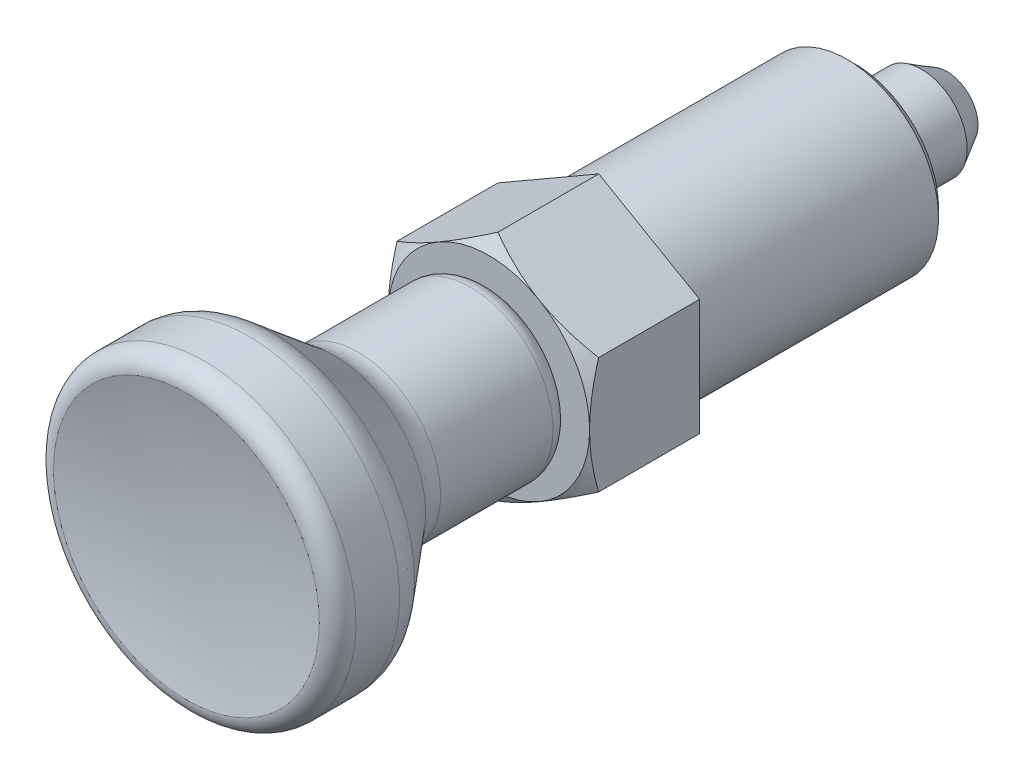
ISO-10303-21;
HEADER;
FILE_DESCRIPTION(('STEP AP214'),'2;1');
FILE_NAME('part.step','',(''),(''),'','','');
FILE_SCHEMA(('AUTOMOTIVE_DESIGN { 1 0 10303 214 1 1 1 1 }'));
ENDSEC;
DATA;
#1=APPLICATION_CONTEXT('core data for automotive mechanical design processes');
#2=APPLICATION_PROTOCOL_DEFINITION('international standard','automotive_design',2000,#1);
#3=PRODUCT_CONTEXT('',#1,'mechanical');
#4=PRODUCT('Part','Part','',(#3));
#5=PRODUCT_RELATED_PRODUCT_CATEGORY('part','',(#4));
#6=PRODUCT_DEFINITION_FORMATION('','',#4);
#7=PRODUCT_DEFINITION_CONTEXT('part definition',#1,'design');
#8=PRODUCT_DEFINITION('design','',#6,#7);
#9=PRODUCT_DEFINITION_SHAPE('','',#8);
#10=(LENGTH_UNIT() NAMED_UNIT(*) SI_UNIT(.MILLI.,.METRE.));
#11=(NAMED_UNIT(*) PLANE_ANGLE_UNIT() SI_UNIT($,.RADIAN.));
#12=(NAMED_UNIT(*) SI_UNIT($,.STERADIAN.) SOLID_ANGLE_UNIT());
#13=UNCERTAINTY_MEASURE_WITH_UNIT(LENGTH_MEASURE(1.E-05),#10,'distance_accuracy_value','');
#14=(GEOMETRIC_REPRESENTATION_CONTEXT(3) GLOBAL_UNCERTAINTY_ASSIGNED_CONTEXT((#13)) GLOBAL_UNIT_ASSIGNED_CONTEXT((#10,
#11,#12)) REPRESENTATION_CONTEXT('',''));
#15=CARTESIAN_POINT('',(0.,0.,0.));
#16=DIRECTION('',(0.,0.,1.));
#17=DIRECTION('',(1.,0.,0.));
#18=AXIS2_PLACEMENT_3D('',#15,#16,#17);
#19=CARTESIAN_POINT('',(0.,0.,9.1132486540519));
#20=DIRECTION('',(0.,0.,-1.));
#21=DIRECTION('',(0.,1.,0.));
#22=AXIS2_PLACEMENT_3D('',#19,#20,#21);
#23=CONICAL_SURFACE('',#22,16.,1.0471975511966);
#24=CARTESIAN_POINT('',(-11.,17.1089612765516,6.60753491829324));
#25=CARTESIAN_POINT('',(-11.,16.8685442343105,6.72428797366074));
#26=CARTESIAN_POINT('',(-11.,16.6278464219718,6.84046259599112));
#27=CARTESIAN_POINT('',(-11.,16.1458306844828,7.07152407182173));
#28=CARTESIAN_POINT('',(-11.,15.9045127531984,7.18641091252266));
#29=CARTESIAN_POINT('',(-11.,15.1794773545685,7.52897336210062));
#30=CARTESIAN_POINT('',(-11.,14.6947486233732,7.7545166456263));
#31=CARTESIAN_POINT('',(-11.,13.7194498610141,8.19976636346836));
#32=CARTESIAN_POINT('',(-11.,13.2288624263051,8.41943476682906));
#33=CARTESIAN_POINT('',(-11.,12.2438036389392,8.84985222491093));
#34=CARTESIAN_POINT('',(-11.,11.7493324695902,9.06060169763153));
#35=CARTESIAN_POINT('',(-11.,10.7395451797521,9.47750065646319));
#36=CARTESIAN_POINT('',(-11.,10.2240743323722,9.68327731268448));
#37=CARTESIAN_POINT('',(-11.,9.18711668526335,10.0793777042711));
#38=CARTESIAN_POINT('',(-11.,8.66562922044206,10.2696997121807));
#39=CARTESIAN_POINT('',(-11.,7.61678576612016,10.6299278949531));
#40=CARTESIAN_POINT('',(-11.,7.08944393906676,10.7998749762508));
#41=CARTESIAN_POINT('',(-11.,6.02714586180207,11.1139425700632));
#42=CARTESIAN_POINT('',(-11.,5.49219205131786,11.2580711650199));
#43=CARTESIAN_POINT('',(-11.,4.68544300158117,11.4493131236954));
#44=CARTESIAN_POINT('',(-11.,4.41655677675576,11.5087715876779));
#45=CARTESIAN_POINT('',(-11.,3.87693780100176,11.6186688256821));
#46=CARTESIAN_POINT('',(-11.,3.60620508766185,11.669107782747));
#47=CARTESIAN_POINT('',(-11.,3.0630760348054,11.7600787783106));
#48=CARTESIAN_POINT('',(-11.,2.79067972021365,11.8006109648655));
#49=CARTESIAN_POINT('',(-11.,2.24450818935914,11.8709617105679));
#50=CARTESIAN_POINT('',(-11.,1.97073302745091,11.9007806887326));
#51=CARTESIAN_POINT('',(-11.,1.42578233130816,11.9487360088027));
#52=CARTESIAN_POINT('',(-11.,1.15461993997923,11.9670207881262));
#53=CARTESIAN_POINT('',(-11.,0.611765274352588,11.9921040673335));
#54=CARTESIAN_POINT('',(-11.,0.340073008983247,11.9989027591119));
#55=CARTESIAN_POINT('',(-11.,-0.203355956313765,12.0008519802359));
#56=CARTESIAN_POINT('',(-11.,-0.475092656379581,11.996002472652));
#57=CARTESIAN_POINT('',(-11.,-1.01811847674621,11.9747741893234));
#58=CARTESIAN_POINT('',(-11.,-1.28940757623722,11.9583948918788));
#59=CARTESIAN_POINT('',(-11.,-1.93990342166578,11.9056460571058));
#60=CARTESIAN_POINT('',(-11.,-2.31868109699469,11.8638892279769));
#61=CARTESIAN_POINT('',(-11.,-3.07346021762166,11.7601616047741));
#62=CARTESIAN_POINT('',(-11.,-3.44946128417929,11.6981881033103));
#63=CARTESIAN_POINT('',(-11.,-4.19831711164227,11.5562316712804));
#64=CARTESIAN_POINT('',(-11.,-4.57116920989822,11.4762348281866));
#65=CARTESIAN_POINT('',(-11.,-5.31315026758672,11.3006758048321));
#66=CARTESIAN_POINT('',(-11.,-5.6822792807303,11.2051138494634));
#67=CARTESIAN_POINT('',(-11.,-6.42494682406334,10.9984902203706));
#68=CARTESIAN_POINT('',(-11.,-6.798402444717,10.8871326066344));
#69=CARTESIAN_POINT('',(-11.,-7.54163547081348,10.6528156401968));
#70=CARTESIAN_POINT('',(-11.,-7.91141285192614,10.5298562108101));
#71=CARTESIAN_POINT('',(-11.,-8.64747031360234,10.2742963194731));
#72=CARTESIAN_POINT('',(-11.,-9.01375149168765,10.1416990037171));
#73=CARTESIAN_POINT('',(-11.,-9.74327252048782,9.86843269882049));
#74=CARTESIAN_POINT('',(-11.,-10.1065124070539,9.72776380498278));
#75=CARTESIAN_POINT('',(-11.,-10.9643323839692,9.38634256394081));
#76=CARTESIAN_POINT('',(-11.,-11.4577333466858,9.18263211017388));
#77=CARTESIAN_POINT('',(-11.,-12.4403196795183,8.76525696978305));
#78=CARTESIAN_POINT('',(-11.,-12.929504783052,8.5515916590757));
#79=CARTESIAN_POINT('',(-11.,-13.9044452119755,8.11630224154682));
#80=CARTESIAN_POINT('',(-11.,-14.3901997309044,7.8946763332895));
#81=CARTESIAN_POINT('',(-11.,-15.3587405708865,7.44507392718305));
#82=CARTESIAN_POINT('',(-11.,-15.8415269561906,7.21709756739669));
#83=CARTESIAN_POINT('',(-11.,-16.8051585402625,6.75572750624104));
#84=CARTESIAN_POINT('',(-11.,-17.28600099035,6.52232807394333));
#85=CARTESIAN_POINT('',(-11.,-18.2456015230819,6.05128373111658));
#86=CARTESIAN_POINT('',(-11.,-18.7243595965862,5.81363880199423));
#87=CARTESIAN_POINT('',(-11.,-19.680049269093,5.33486366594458));
#88=CARTESIAN_POINT('',(-11.,-20.1569810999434,5.09373392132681));
#89=CARTESIAN_POINT('',(-11.,-21.1093452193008,4.60852948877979));
#90=CARTESIAN_POINT('',(-11.,-21.5847775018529,4.36445478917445));
#91=CARTESIAN_POINT('',(-11.,-22.9292051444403,3.66982978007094));
#92=CARTESIAN_POINT('',(-11.,-23.7966959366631,3.21636748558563));
#93=CARTESIAN_POINT('',(-11.,-25.5284407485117,2.30324363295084));
#94=CARTESIAN_POINT('',(-11.,-26.3926946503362,1.8435818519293));
#95=CARTESIAN_POINT('',(-11.,-28.1164832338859,0.920679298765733));
#96=CARTESIAN_POINT('',(-11.,-28.9760243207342,0.457450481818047));
#97=CARTESIAN_POINT('',(-11.,-30.2638094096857,-0.240150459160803));
#98=CARTESIAN_POINT('',(-11.,-30.6928049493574,-0.473137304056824));
#99=CARTESIAN_POINT('',(-11.,-31.5503448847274,-0.939938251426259));
#100=CARTESIAN_POINT('',(-11.,-31.9788892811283,-1.17375235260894));
#101=CARTESIAN_POINT('',(-11.,-32.4072336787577,-1.40793238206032));
#102=B_SPLINE_CURVE_WITH_KNOTS('',3,(#24,#25,#26,#27,#28,#29,#30,#31,#32,#33,#34,#35,#36,#37,
#38,#39,#40,#41,#42,#43,#44,#45,#46,#47,#48,#49,#50,#51,#52,#53,#54,#55,#56,#57,#58,#59,#60,#61,
#62,#63,#64,#65,#66,#67,#68,#69,#70,#71,#72,#73,#74,#75,#76,#77,#78,#79,#80,#81,#82,#83,#84,#85,
#86,#87,#88,#89,#90,#91,#92,#93,#94,#95,#96,#97,#98,#99,#100,#101),.UNSPECIFIED.,.F.,.F.,(4,2,2,
2,2,2,2,2,2,2,2,2,2,2,2,2,2,2,2,2,2,2,2,2,2,2,2,2,2,2,2,2,2,2,2,2,2,2,4),(0.,0.801799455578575,
1.60360687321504,3.20745640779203,4.81995415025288,6.43237623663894,8.09726600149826,
9.7623416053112,11.424016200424,13.0851696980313,13.9111881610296,14.7371898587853,
15.5631792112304,16.3891362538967,17.2042344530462,18.0193190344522,18.834406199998,
19.649530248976,20.7921162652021,21.9348553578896,23.0784795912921,24.2220873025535,
25.3909758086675,26.5598720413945,27.7283883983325,28.8968909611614,30.498142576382,
32.0994947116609,33.7012115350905,35.3028935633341,36.9063529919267,38.5098194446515,
40.1130750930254,41.7163371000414,44.6528813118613,47.5895313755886,50.5187725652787,
51.9833129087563,53.4478509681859),.UNSPECIFIED.);
#103=CARTESIAN_POINT('',(-11.,-6.3508529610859,11.0175196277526));
#104=VERTEX_POINT('',#103);
#105=CARTESIAN_POINT('',(-11.,0.,12.));
#106=VERTEX_POINT('',#105);
#107=EDGE_CURVE('E9',#104,#106,#102,.F.);
#108=ORIENTED_EDGE('',*,*,#107,.F.);
#109=CARTESIAN_POINT('',(0.000200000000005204,-12.7018213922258,11.0174529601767));
#110=CARTESIAN_POINT('',(-0.241603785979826,-12.5622159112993,11.0980408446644));
#111=CARTESIAN_POINT('',(-0.484309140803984,-12.4220899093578,11.1749710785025));
#112=CARTESIAN_POINT('',(-0.971666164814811,-12.1407142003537,11.3205013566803));
#113=CARTESIAN_POINT('',(-1.21631844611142,-11.9994641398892,11.3890986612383));
#114=CARTESIAN_POINT('',(-1.95421736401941,-11.5734380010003,11.5810636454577));
#115=CARTESIAN_POINT('',(-2.45037695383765,-11.2869801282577,11.6902522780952));
#116=CARTESIAN_POINT('',(-3.19285703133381,-10.8583090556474,11.8182858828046));
#117=CARTESIAN_POINT('',(-3.43695934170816,-10.7173765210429,11.8547577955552));
#118=CARTESIAN_POINT('',(-3.92629418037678,-10.4348589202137,11.9159186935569));
#119=CARTESIAN_POINT('',(-4.17152673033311,-10.2932738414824,11.9406074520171));
#120=CARTESIAN_POINT('',(-4.6624006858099,-10.0098676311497,11.9775696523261));
#121=CARTESIAN_POINT('',(-4.90804125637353,-9.86804698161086,11.9898578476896));
#122=CARTESIAN_POINT('',(-5.39955001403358,-9.58427426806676,12.0017570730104));
#123=CARTESIAN_POINT('',(-5.64541819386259,-9.44232220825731,12.0013684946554));
#124=CARTESIAN_POINT('',(-6.1050701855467,-9.17694200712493,11.9887988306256));
#125=CARTESIAN_POINT('',(-6.31888677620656,-9.05349494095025,11.9781509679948));
#126=CARTESIAN_POINT('',(-6.74602818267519,-8.80688473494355,11.9474683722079));
#127=CARTESIAN_POINT('',(-6.95935296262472,-8.68372161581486,11.9274329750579));
#128=CARTESIAN_POINT('',(-7.38539481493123,-8.43774623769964,11.8783246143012));
#129=CARTESIAN_POINT('',(-7.59811123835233,-8.31493435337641,11.8492441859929));
#130=CARTESIAN_POINT('',(-8.0225468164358,-8.06988635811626,11.7825560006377));
#131=CARTESIAN_POINT('',(-8.23426590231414,-7.94765028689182,11.7449476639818));
#132=CARTESIAN_POINT('',(-8.87695113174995,-7.57659579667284,11.6183800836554));
#133=CARTESIAN_POINT('',(-9.30605612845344,-7.32885191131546,11.5168005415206));
#134=CARTESIAN_POINT('',(-10.1578675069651,-6.83705838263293,11.2862563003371));
#135=CARTESIAN_POINT('',(-10.580584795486,-6.59300244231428,11.1573457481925));
#136=CARTESIAN_POINT('',(-11.0002,-6.35073749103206,11.0174529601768));
#137=B_SPLINE_CURVE_WITH_KNOTS('',3,(#109,#110,#111,#112,#113,#114,#115,#116,#117,#118,#119,
#120,#121,#122,#123,#124,#125,#126,#127,#128,#129,#130,#131,#132,#133,#134,#135,#136),
.UNSPECIFIED.,.F.,.F.,(4,2,2,2,2,2,2,2,2,2,2,2,2,4),(0.,0.871755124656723,1.74379610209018,
3.49159027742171,4.34403665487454,5.19649943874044,6.0479468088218,6.89936787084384,
7.64056020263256,8.38180496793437,9.12366309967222,9.86557166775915,11.3820155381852,
12.8954827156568),.UNSPECIFIED.);
#138=CARTESIAN_POINT('',(-5.50000000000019,-9.52627944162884,12.));
#139=VERTEX_POINT('',#138);
#140=EDGE_CURVE('E204',#139,#104,#137,.T.);
#141=ORIENTED_EDGE('',*,*,#140,.F.);
#142=CARTESIAN_POINT('',(0.,0.,12.));
#143=DIRECTION('',(0.,0.,1.));
#144=DIRECTION('',(0.,-1.,0.));
#145=AXIS2_PLACEMENT_3D('',#142,#143,#144);
#146=CIRCLE('',#145,11.);
#147=EDGE_CURVE('E262',#106,#139,#146,.T.);
#148=ORIENTED_EDGE('',*,*,#147,.F.);
#149=EDGE_LOOP('',(#108,#141,#148));
#150=FACE_BOUND('',#149,.T.);
#151=ADVANCED_FACE('F14',(#150),#23,.T.);
#152=CARTESIAN_POINT('',(-11.,6.3508529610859,11.0175196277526));
#153=VERTEX_POINT('',#152);
#154=EDGE_CURVE('E18',#106,#153,#102,.F.);
#155=ORIENTED_EDGE('',*,*,#154,.F.);
#156=CARTESIAN_POINT('',(-5.50000000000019,9.52627944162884,12.));
#157=VERTEX_POINT('',#156);
#158=EDGE_CURVE('E116',#157,#106,#146,.T.);
#159=ORIENTED_EDGE('',*,*,#158,.F.);
#160=CARTESIAN_POINT('',(-11.0002,6.35073749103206,11.0174529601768));
#161=CARTESIAN_POINT('',(-10.7583962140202,6.49034297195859,11.0980408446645));
#162=CARTESIAN_POINT('',(-10.515690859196,6.63046897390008,11.1749710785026));
#163=CARTESIAN_POINT('',(-10.0283338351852,6.91184468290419,11.3205013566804));
#164=CARTESIAN_POINT('',(-9.78368155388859,7.05309474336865,11.3890986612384));
#165=CARTESIAN_POINT('',(-9.04578263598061,7.47912088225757,11.5810636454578));
#166=CARTESIAN_POINT('',(-8.54962304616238,7.76557875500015,11.6902522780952));
#167=CARTESIAN_POINT('',(-7.80714296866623,8.1942498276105,11.8182858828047));
#168=CARTESIAN_POINT('',(-7.56304065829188,8.33518236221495,11.8547577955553));
#169=CARTESIAN_POINT('',(-7.07370581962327,8.61769996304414,11.915918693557));
#170=CARTESIAN_POINT('',(-6.82847326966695,8.75928504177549,11.9406074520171));
#171=CARTESIAN_POINT('',(-6.33759931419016,9.0426912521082,11.9775696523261));
#172=CARTESIAN_POINT('',(-6.09195874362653,9.184511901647,11.9898578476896));
#173=CARTESIAN_POINT('',(-5.60044998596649,9.4682846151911,12.0017570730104));
#174=CARTESIAN_POINT('',(-5.35458180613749,9.61023667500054,12.0013684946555));
#175=CARTESIAN_POINT('',(-4.89492981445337,9.87561687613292,11.9887988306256));
#176=CARTESIAN_POINT('',(-4.68111322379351,9.99906394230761,11.9781509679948));
#177=CARTESIAN_POINT('',(-4.25397181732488,10.2456741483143,11.9474683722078));
#178=CARTESIAN_POINT('',(-4.04064703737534,10.368837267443,11.9274329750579));
#179=CARTESIAN_POINT('',(-3.61460518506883,10.6148126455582,11.8783246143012));
#180=CARTESIAN_POINT('',(-3.40188876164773,10.7376245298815,11.8492441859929));
#181=CARTESIAN_POINT('',(-2.97745318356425,10.9826725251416,11.7825560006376));
#182=CARTESIAN_POINT('',(-2.76573409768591,11.1049085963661,11.7449476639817));
#183=CARTESIAN_POINT('',(-2.12304886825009,11.475963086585,11.6183800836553));
#184=CARTESIAN_POINT('',(-1.69394387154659,11.7237069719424,11.5168005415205));
#185=CARTESIAN_POINT('',(-0.842132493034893,12.215500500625,11.286256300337));
#186=CARTESIAN_POINT('',(-0.419415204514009,12.4595564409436,11.1573457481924));
#187=CARTESIAN_POINT('',(0.000199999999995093,12.7018213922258,11.0174529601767));
#188=B_SPLINE_CURVE_WITH_KNOTS('',3,(#160,#161,#162,#163,#164,#165,#166,#167,#168,#169,#170,
#171,#172,#173,#174,#175,#176,#177,#178,#179,#180,#181,#182,#183,#184,#185,#186,#187),
.UNSPECIFIED.,.F.,.F.,(4,2,2,2,2,2,2,2,2,2,2,2,2,4),(0.,0.871755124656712,1.74379610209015,
3.49159027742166,4.34403665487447,5.19649943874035,6.0479468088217,6.89936787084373,
7.64056020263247,8.38180496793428,9.12366309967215,9.86557166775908,11.3820155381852,
12.8954827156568),.UNSPECIFIED.);
#189=EDGE_CURVE('E265',#153,#157,#188,.T.);
#190=ORIENTED_EDGE('',*,*,#189,.F.);
#191=EDGE_LOOP('',(#155,#159,#190));
#192=FACE_BOUND('',#191,.T.);
#193=ADVANCED_FACE('F226',(#192),#23,.T.);
#194=CARTESIAN_POINT('',(0.,12.701705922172,11.0175196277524));
#195=VERTEX_POINT('',#194);
#196=EDGE_CURVE('E112',#157,#195,#188,.T.);
#197=ORIENTED_EDGE('',*,*,#196,.F.);
#198=CARTESIAN_POINT('',(5.50000000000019,9.52627944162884,12.));
#199=VERTEX_POINT('',#198);
#200=EDGE_CURVE('E110',#199,#157,#146,.T.);
#201=ORIENTED_EDGE('',*,*,#200,.F.);
#202=CARTESIAN_POINT('',(-0.000200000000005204,12.7018213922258,11.0174529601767));
#203=CARTESIAN_POINT('',(0.241603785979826,12.5622159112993,11.0980408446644));
#204=CARTESIAN_POINT('',(0.484309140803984,12.4220899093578,11.1749710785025));
#205=CARTESIAN_POINT('',(0.971666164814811,12.1407142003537,11.3205013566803));
#206=CARTESIAN_POINT('',(1.21631844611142,11.9994641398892,11.3890986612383));
#207=CARTESIAN_POINT('',(1.95421736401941,11.5734380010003,11.5810636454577));
#208=CARTESIAN_POINT('',(2.45037695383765,11.2869801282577,11.6902522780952));
#209=CARTESIAN_POINT('',(3.19285703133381,10.8583090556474,11.8182858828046));
#210=CARTESIAN_POINT('',(3.43695934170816,10.7173765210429,11.8547577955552));
#211=CARTESIAN_POINT('',(3.92629418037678,10.4348589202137,11.9159186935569));
#212=CARTESIAN_POINT('',(4.17152673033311,10.2932738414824,11.9406074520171));
#213=CARTESIAN_POINT('',(4.6624006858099,10.0098676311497,11.9775696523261));
#214=CARTESIAN_POINT('',(4.90804125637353,9.86804698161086,11.9898578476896));
#215=CARTESIAN_POINT('',(5.39955001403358,9.58427426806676,12.0017570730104));
#216=CARTESIAN_POINT('',(5.64541819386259,9.44232220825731,12.0013684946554));
#217=CARTESIAN_POINT('',(6.1050701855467,9.17694200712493,11.9887988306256));
#218=CARTESIAN_POINT('',(6.31888677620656,9.05349494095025,11.9781509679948));
#219=CARTESIAN_POINT('',(6.74602818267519,8.80688473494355,11.9474683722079));
#220=CARTESIAN_POINT('',(6.95935296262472,8.68372161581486,11.9274329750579));
#221=CARTESIAN_POINT('',(7.38539481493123,8.43774623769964,11.8783246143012));
#222=CARTESIAN_POINT('',(7.59811123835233,8.31493435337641,11.8492441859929));
#223=CARTESIAN_POINT('',(8.0225468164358,8.06988635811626,11.7825560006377));
#224=CARTESIAN_POINT('',(8.23426590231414,7.94765028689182,11.7449476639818));
#225=CARTESIAN_POINT('',(8.87695113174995,7.57659579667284,11.6183800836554));
#226=CARTESIAN_POINT('',(9.30605612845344,7.32885191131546,11.5168005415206));
#227=CARTESIAN_POINT('',(10.1578675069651,6.83705838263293,11.2862563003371));
#228=CARTESIAN_POINT('',(10.580584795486,6.59300244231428,11.1573457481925));
#229=CARTESIAN_POINT('',(11.0002,6.35073749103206,11.0174529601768));
#230=B_SPLINE_CURVE_WITH_KNOTS('',3,(#202,#203,#204,#205,#206,#207,#208,#209,#210,#211,#212,
#213,#214,#215,#216,#217,#218,#219,#220,#221,#222,#223,#224,#225,#226,#227,#228,#229),
.UNSPECIFIED.,.F.,.F.,(4,2,2,2,2,2,2,2,2,2,2,2,2,4),(0.,0.871755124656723,1.74379610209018,
3.49159027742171,4.34403665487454,5.19649943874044,6.0479468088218,6.89936787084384,
7.64056020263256,8.38180496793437,9.12366309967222,9.86557166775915,11.3820155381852,
12.8954827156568),.UNSPECIFIED.);
#231=EDGE_CURVE('E90',#195,#199,#230,.T.);
#232=ORIENTED_EDGE('',*,*,#231,.F.);
#233=EDGE_LOOP('',(#197,#201,#232));
#234=FACE_BOUND('',#233,.T.);
#235=ADVANCED_FACE('F111',(#234),#23,.T.);
#236=CARTESIAN_POINT('',(0.,-12.701705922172,11.0175196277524));
#237=VERTEX_POINT('',#236);
#238=EDGE_CURVE('E199',#237,#139,#137,.T.);
#239=ORIENTED_EDGE('',*,*,#238,.F.);
#240=CARTESIAN_POINT('',(11.0002,-6.35073749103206,11.0174529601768));
#241=CARTESIAN_POINT('',(10.7583962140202,-6.49034297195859,11.0980408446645));
#242=CARTESIAN_POINT('',(10.515690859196,-6.63046897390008,11.1749710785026));
#243=CARTESIAN_POINT('',(10.0283338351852,-6.91184468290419,11.3205013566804));
#244=CARTESIAN_POINT('',(9.78368155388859,-7.05309474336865,11.3890986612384));
#245=CARTESIAN_POINT('',(9.04578263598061,-7.47912088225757,11.5810636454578));
#246=CARTESIAN_POINT('',(8.54962304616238,-7.76557875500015,11.6902522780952));
#247=CARTESIAN_POINT('',(7.80714296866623,-8.1942498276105,11.8182858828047));
#248=CARTESIAN_POINT('',(7.56304065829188,-8.33518236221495,11.8547577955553));
#249=CARTESIAN_POINT('',(7.07370581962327,-8.61769996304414,11.915918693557));
#250=CARTESIAN_POINT('',(6.82847326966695,-8.75928504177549,11.9406074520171));
#251=CARTESIAN_POINT('',(6.33759931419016,-9.0426912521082,11.9775696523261));
#252=CARTESIAN_POINT('',(6.09195874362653,-9.184511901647,11.9898578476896));
#253=CARTESIAN_POINT('',(5.60044998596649,-9.4682846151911,12.0017570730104));
#254=CARTESIAN_POINT('',(5.35458180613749,-9.61023667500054,12.0013684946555));
#255=CARTESIAN_POINT('',(4.89492981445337,-9.87561687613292,11.9887988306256));
#256=CARTESIAN_POINT('',(4.68111322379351,-9.99906394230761,11.9781509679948));
#257=CARTESIAN_POINT('',(4.25397181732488,-10.2456741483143,11.9474683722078));
#258=CARTESIAN_POINT('',(4.04064703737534,-10.368837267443,11.9274329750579));
#259=CARTESIAN_POINT('',(3.61460518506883,-10.6148126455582,11.8783246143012));
#260=CARTESIAN_POINT('',(3.40188876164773,-10.7376245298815,11.8492441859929));
#261=CARTESIAN_POINT('',(2.97745318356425,-10.9826725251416,11.7825560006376));
#262=CARTESIAN_POINT('',(2.76573409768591,-11.1049085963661,11.7449476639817));
#263=CARTESIAN_POINT('',(2.12304886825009,-11.475963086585,11.6183800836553));
#264=CARTESIAN_POINT('',(1.69394387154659,-11.7237069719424,11.5168005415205));
#265=CARTESIAN_POINT('',(0.842132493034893,-12.215500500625,11.286256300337));
#266=CARTESIAN_POINT('',(0.419415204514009,-12.4595564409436,11.1573457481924));
#267=CARTESIAN_POINT('',(-0.000199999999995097,-12.7018213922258,11.0174529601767));
#268=B_SPLINE_CURVE_WITH_KNOTS('',3,(#240,#241,#242,#243,#244,#245,#246,#247,#248,#249,#250,
#251,#252,#253,#254,#255,#256,#257,#258,#259,#260,#261,#262,#263,#264,#265,#266,#267),
.UNSPECIFIED.,.F.,.F.,(4,2,2,2,2,2,2,2,2,2,2,2,2,4),(0.,0.871755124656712,1.74379610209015,
3.49159027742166,4.34403665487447,5.19649943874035,6.0479468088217,6.89936787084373,
7.64056020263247,8.38180496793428,9.12366309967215,9.86557166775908,11.3820155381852,
12.8954827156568),.UNSPECIFIED.);
#269=CARTESIAN_POINT('',(5.50000000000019,-9.52627944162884,12.));
#270=VERTEX_POINT('',#269);
#271=EDGE_CURVE('E100',#270,#237,#268,.T.);
#272=ORIENTED_EDGE('',*,*,#271,.F.);
#273=EDGE_CURVE('E123',#139,#270,#146,.T.);
#274=ORIENTED_EDGE('',*,*,#273,.F.);
#275=EDGE_LOOP('',(#239,#272,#274));
#276=FACE_BOUND('',#275,.T.);
#277=ADVANCED_FACE('F244',(#276),#23,.T.);
#278=CARTESIAN_POINT('',(11.,6.3508529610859,11.0175196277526));
#279=VERTEX_POINT('',#278);
#280=EDGE_CURVE('E94',#199,#279,#230,.T.);
#281=ORIENTED_EDGE('',*,*,#280,.F.);
#282=CARTESIAN_POINT('',(11.,0.,12.));
#283=VERTEX_POINT('',#282);
#284=EDGE_CURVE('E106',#283,#199,#146,.T.);
#285=ORIENTED_EDGE('',*,*,#284,.F.);
#286=CARTESIAN_POINT('',(11.,17.1089612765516,6.60753491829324));
#287=CARTESIAN_POINT('',(11.,16.8685442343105,6.72428797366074));
#288=CARTESIAN_POINT('',(11.,16.6278464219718,6.84046259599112));
#289=CARTESIAN_POINT('',(11.,16.1458306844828,7.07152407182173));
#290=CARTESIAN_POINT('',(11.,15.9045127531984,7.18641091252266));
#291=CARTESIAN_POINT('',(11.,15.1794773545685,7.52897336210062));
#292=CARTESIAN_POINT('',(11.,14.6947486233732,7.7545166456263));
#293=CARTESIAN_POINT('',(11.,13.7194498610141,8.19976636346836));
#294=CARTESIAN_POINT('',(11.,13.2288624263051,8.41943476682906));
#295=CARTESIAN_POINT('',(11.,12.2438036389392,8.84985222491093));
#296=CARTESIAN_POINT('',(11.,11.7493324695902,9.06060169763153));
#297=CARTESIAN_POINT('',(11.,10.7395451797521,9.47750065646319));
#298=CARTESIAN_POINT('',(11.,10.2240743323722,9.68327731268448));
#299=CARTESIAN_POINT('',(11.,9.18711668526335,10.0793777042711));
#300=CARTESIAN_POINT('',(11.,8.66562922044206,10.2696997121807));
#301=CARTESIAN_POINT('',(11.,7.61678576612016,10.6299278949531));
#302=CARTESIAN_POINT('',(11.,7.08944393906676,10.7998749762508));
#303=CARTESIAN_POINT('',(11.,6.02714586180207,11.1139425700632));
#304=CARTESIAN_POINT('',(11.,5.49219205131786,11.2580711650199));
#305=CARTESIAN_POINT('',(11.,4.68544300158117,11.4493131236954));
#306=CARTESIAN_POINT('',(11.,4.41655677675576,11.5087715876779));
#307=CARTESIAN_POINT('',(11.,3.87693780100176,11.6186688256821));
#308=CARTESIAN_POINT('',(11.,3.60620508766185,11.669107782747));
#309=CARTESIAN_POINT('',(11.,3.0630760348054,11.7600787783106));
#310=CARTESIAN_POINT('',(11.,2.79067972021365,11.8006109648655));
#311=CARTESIAN_POINT('',(11.,2.24450818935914,11.8709617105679));
#312=CARTESIAN_POINT('',(11.,1.97073302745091,11.9007806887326));
#313=CARTESIAN_POINT('',(11.,1.42578233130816,11.9487360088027));
#314=CARTESIAN_POINT('',(11.,1.15461993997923,11.9670207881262));
#315=CARTESIAN_POINT('',(11.,0.611765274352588,11.9921040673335));
#316=CARTESIAN_POINT('',(11.,0.340073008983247,11.9989027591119));
#317=CARTESIAN_POINT('',(11.,-0.203355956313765,12.0008519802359));
#318=CARTESIAN_POINT('',(11.,-0.475092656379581,11.996002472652));
#319=CARTESIAN_POINT('',(11.,-1.01811847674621,11.9747741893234));
#320=CARTESIAN_POINT('',(11.,-1.28940757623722,11.9583948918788));
#321=CARTESIAN_POINT('',(11.,-1.93990342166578,11.9056460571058));
#322=CARTESIAN_POINT('',(11.,-2.31868109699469,11.8638892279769));
#323=CARTESIAN_POINT('',(11.,-3.07346021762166,11.7601616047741));
#324=CARTESIAN_POINT('',(11.,-3.44946128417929,11.6981881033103));
#325=CARTESIAN_POINT('',(11.,-4.19831711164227,11.5562316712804));
#326=CARTESIAN_POINT('',(11.,-4.57116920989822,11.4762348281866));
#327=CARTESIAN_POINT('',(11.,-5.31315026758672,11.3006758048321));
#328=CARTESIAN_POINT('',(11.,-5.6822792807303,11.2051138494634));
#329=CARTESIAN_POINT('',(11.,-6.42494682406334,10.9984902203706));
#330=CARTESIAN_POINT('',(11.,-6.798402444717,10.8871326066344));
#331=CARTESIAN_POINT('',(11.,-7.54163547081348,10.6528156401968));
#332=CARTESIAN_POINT('',(11.,-7.91141285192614,10.5298562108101));
#333=CARTESIAN_POINT('',(11.,-8.64747031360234,10.2742963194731));
#334=CARTESIAN_POINT('',(11.,-9.01375149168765,10.1416990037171));
#335=CARTESIAN_POINT('',(11.,-9.74327252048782,9.86843269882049));
#336=CARTESIAN_POINT('',(11.,-10.1065124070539,9.72776380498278));
#337=CARTESIAN_POINT('',(11.,-10.9643323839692,9.38634256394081));
#338=CARTESIAN_POINT('',(11.,-11.4577333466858,9.18263211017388));
#339=CARTESIAN_POINT('',(11.,-12.4403196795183,8.76525696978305));
#340=CARTESIAN_POINT('',(11.,-12.929504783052,8.5515916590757));
#341=CARTESIAN_POINT('',(11.,-13.9044452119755,8.11630224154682));
#342=CARTESIAN_POINT('',(11.,-14.3901997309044,7.8946763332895));
#343=CARTESIAN_POINT('',(11.,-15.3587405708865,7.44507392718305));
#344=CARTESIAN_POINT('',(11.,-15.8415269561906,7.21709756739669));
#345=CARTESIAN_POINT('',(11.,-16.8051585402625,6.75572750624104));
#346=CARTESIAN_POINT('',(11.,-17.28600099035,6.52232807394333));
#347=CARTESIAN_POINT('',(11.,-18.2456015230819,6.05128373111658));
#348=CARTESIAN_POINT('',(11.,-18.7243595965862,5.81363880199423));
#349=CARTESIAN_POINT('',(11.,-19.680049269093,5.33486366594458));
#350=CARTESIAN_POINT('',(11.,-20.1569810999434,5.09373392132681));
#351=CARTESIAN_POINT('',(11.,-21.1093452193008,4.60852948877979));
#352=CARTESIAN_POINT('',(11.,-21.5847775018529,4.36445478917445));
#353=CARTESIAN_POINT('',(11.,-22.9292051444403,3.66982978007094));
#354=CARTESIAN_POINT('',(11.,-23.7966959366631,3.21636748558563));
#355=CARTESIAN_POINT('',(11.,-25.5284407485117,2.30324363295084));
#356=CARTESIAN_POINT('',(11.,-26.3926946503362,1.8435818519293));
#357=CARTESIAN_POINT('',(11.,-28.1164832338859,0.920679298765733));
#358=CARTESIAN_POINT('',(11.,-28.9760243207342,0.457450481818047));
#359=CARTESIAN_POINT('',(11.,-30.2638094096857,-0.240150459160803));
#360=CARTESIAN_POINT('',(11.,-30.6928049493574,-0.473137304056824));
#361=CARTESIAN_POINT('',(11.,-31.5503448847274,-0.939938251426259));
#362=CARTESIAN_POINT('',(11.,-31.9788892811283,-1.17375235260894));
#363=CARTESIAN_POINT('',(11.,-32.4072336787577,-1.40793238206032));
#364=B_SPLINE_CURVE_WITH_KNOTS('',3,(#286,#287,#288,#289,#290,#291,#292,#293,#294,#295,#296,
#297,#298,#299,#300,#301,#302,#303,#304,#305,#306,#307,#308,#309,#310,#311,#312,#313,#314,#315,
#316,#317,#318,#319,#320,#321,#322,#323,#324,#325,#326,#327,#328,#329,#330,#331,#332,#333,#334,
#335,#336,#337,#338,#339,#340,#341,#342,#343,#344,#345,#346,#347,#348,#349,#350,#351,#352,#353,
#354,#355,#356,#357,#358,#359,#360,#361,#362,#363),.UNSPECIFIED.,.F.,.F.,(4,2,2,2,2,2,2,2,2,2,2,
2,2,2,2,2,2,2,2,2,2,2,2,2,2,2,2,2,2,2,2,2,2,2,2,2,2,2,4),(0.,0.801799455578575,1.60360687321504,
3.20745640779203,4.81995415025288,6.43237623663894,8.09726600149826,9.7623416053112,
11.424016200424,13.0851696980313,13.9111881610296,14.7371898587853,15.5631792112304,
16.3891362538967,17.2042344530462,18.0193190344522,18.834406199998,19.649530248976,
20.7921162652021,21.9348553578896,23.0784795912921,24.2220873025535,25.3909758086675,
26.5598720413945,27.7283883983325,28.8968909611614,30.498142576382,32.0994947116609,
33.7012115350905,35.3028935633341,36.9063529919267,38.5098194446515,40.1130750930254,
41.7163371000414,44.6528813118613,47.5895313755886,50.5187725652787,51.9833129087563,
53.4478509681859),.UNSPECIFIED.);
#365=EDGE_CURVE('E41',#279,#283,#364,.T.);
#366=ORIENTED_EDGE('',*,*,#365,.F.);
#367=EDGE_LOOP('',(#281,#285,#366));
#368=FACE_BOUND('',#367,.T.);
#369=ADVANCED_FACE('F104',(#368),#23,.T.);
#370=CARTESIAN_POINT('',(11.,-6.3508529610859,11.0175196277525));
#371=VERTEX_POINT('',#370);
#372=EDGE_CURVE('E108',#371,#270,#268,.T.);
#373=ORIENTED_EDGE('',*,*,#372,.F.);
#374=EDGE_CURVE('E169',#283,#371,#364,.T.);
#375=ORIENTED_EDGE('',*,*,#374,.F.);
#376=EDGE_CURVE('E121',#270,#283,#146,.T.);
#377=ORIENTED_EDGE('',*,*,#376,.F.);
#378=EDGE_LOOP('',(#373,#375,#377));
#379=FACE_BOUND('',#378,.T.);
#380=ADVANCED_FACE('F228',(#379),#23,.T.);
#381=CARTESIAN_POINT('',(-1.11213122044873E-11,0.,109.387498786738));
#382=DIRECTION('',(0.,0.,1.));
#383=DIRECTION('',(1.,0.,0.));
#384=AXIS2_PLACEMENT_3D('',#381,#382,#383);
#385=SPHERICAL_SURFACE('',#384,66.0000000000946);
#386=CARTESIAN_POINT('',(0.,0.,45.));
#387=DIRECTION('',(0.,0.,1.));
#388=DIRECTION('',(0.,-1.,0.));
#389=AXIS2_PLACEMENT_3D('',#386,#387,#388);
#390=CIRCLE('',#389,14.500000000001);
#391=CARTESIAN_POINT('',(0.,-14.500000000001,45.));
#392=VERTEX_POINT('',#391);
#393=EDGE_CURVE('E166',#392,#392,#390,.T.);
#394=ORIENTED_EDGE('',*,*,#393,.T.);
#395=EDGE_LOOP('',(#394));
#396=FACE_BOUND('',#395,.T.);
#397=ADVANCED_FACE('F16',(#396),#385,.F.);
#398=CARTESIAN_POINT('',(0.,0.,43.));
#399=DIRECTION('',(0.,0.,1.));
#400=DIRECTION('',(0.,-1.,0.));
#401=AXIS2_PLACEMENT_3D('',#398,#399,#400);
#402=TOROIDAL_SURFACE('',#401,14.4999999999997,2.00000000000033);
#403=CARTESIAN_POINT('',(0.,0.,43.));
#404=DIRECTION('',(0.,0.,1.));
#405=DIRECTION('',(0.,-1.,0.));
#406=AXIS2_PLACEMENT_3D('',#403,#404,#405);
#407=CIRCLE('',#406,16.5);
#408=CARTESIAN_POINT('',(0.,-16.5,43.));
#409=VERTEX_POINT('',#408);
#410=EDGE_CURVE('E163',#409,#409,#407,.T.);
#411=ORIENTED_EDGE('',*,*,#410,.T.);
#412=EDGE_LOOP('',(#411));
#413=FACE_BOUND('',#412,.T.);
#414=ORIENTED_EDGE('',*,*,#393,.F.);
#415=EDGE_LOOP('',(#414));
#416=FACE_BOUND('',#415,.T.);
#417=ADVANCED_FACE('F242',(#413,#416),#402,.T.);
#418=CARTESIAN_POINT('',(0.,0.,-38.));
#419=DIRECTION('',(0.,0.,1.));
#420=DIRECTION('',(0.,-1.,0.));
#421=AXIS2_PLACEMENT_3D('',#418,#419,#420);
#422=CYLINDRICAL_SURFACE('',#421,16.5);
#423=CARTESIAN_POINT('',(0.,0.,38.235930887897));
#424=DIRECTION('',(0.,0.,1.));
#425=DIRECTION('',(0.,-1.,0.));
#426=AXIS2_PLACEMENT_3D('',#423,#424,#425);
#427=CIRCLE('',#426,16.5);
#428=CARTESIAN_POINT('',(0.,-16.5,38.235930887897));
#429=VERTEX_POINT('',#428);
#430=EDGE_CURVE('E160',#429,#429,#427,.T.);
#431=ORIENTED_EDGE('',*,*,#430,.T.);
#432=EDGE_LOOP('',(#431));
#433=FACE_BOUND('',#432,.T.);
#434=ORIENTED_EDGE('',*,*,#410,.F.);
#435=EDGE_LOOP('',(#434));
#436=FACE_BOUND('',#435,.T.);
#437=ADVANCED_FACE('F342',(#433,#436),#422,.T.);
#438=CARTESIAN_POINT('',(0.,0.,38.2359308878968));
#439=DIRECTION('',(0.,0.,1.));
#440=DIRECTION('',(0.,-1.,0.));
#441=AXIS2_PLACEMENT_3D('',#438,#439,#440);
#442=TOROIDAL_SURFACE('',#441,12.499999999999,4.00000000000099);
#443=CARTESIAN_POINT('',(0.,0.,35.691913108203));
#444=DIRECTION('',(0.,0.,1.));
#445=DIRECTION('',(0.,-1.,0.));
#446=AXIS2_PLACEMENT_3D('',#443,#444,#445);
#447=CIRCLE('',#446,15.586741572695);
#448=CARTESIAN_POINT('',(0.,-15.586741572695,35.691913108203));
#449=VERTEX_POINT('',#448);
#450=EDGE_CURVE('E157',#449,#449,#447,.T.);
#451=ORIENTED_EDGE('',*,*,#450,.T.);
#452=EDGE_LOOP('',(#451));
#453=FACE_BOUND('',#452,.T.);
#454=ORIENTED_EDGE('',*,*,#430,.F.);
#455=EDGE_LOOP('',(#454));
#456=FACE_BOUND('',#455,.T.);
#457=ADVANCED_FACE('F338',(#453,#456),#442,.T.);
#458=CARTESIAN_POINT('',(0.,0.,35.691913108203));
#459=DIRECTION('',(0.,0.,1.));
#460=DIRECTION('',(0.,-1.,0.));
#461=AXIS2_PLACEMENT_3D('',#458,#459,#460);
#462=CONICAL_SURFACE('',#461,15.586741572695,0.689309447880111);
#463=CARTESIAN_POINT('',(0.,0.,28.808086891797));
#464=DIRECTION('',(0.,0.,1.));
#465=DIRECTION('',(0.,-1.,0.));
#466=AXIS2_PLACEMENT_3D('',#463,#464,#465);
#467=CIRCLE('',#466,9.9132584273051);
#468=CARTESIAN_POINT('',(0.,-9.9132584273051,28.808086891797));
#469=VERTEX_POINT('',#468);
#470=EDGE_CURVE('E154',#469,#469,#467,.T.);
#471=ORIENTED_EDGE('',*,*,#470,.T.);
#472=EDGE_LOOP('',(#471));
#473=FACE_BOUND('',#472,.T.);
#474=ORIENTED_EDGE('',*,*,#450,.F.);
#475=EDGE_LOOP('',(#474));
#476=FACE_BOUND('',#475,.T.);
#477=ADVANCED_FACE('F334',(#473,#476),#462,.T.);
#478=CARTESIAN_POINT('',(0.,0.,26.2640691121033));
#479=DIRECTION('',(0.,0.,1.));
#480=DIRECTION('',(0.,-1.,0.));
#481=AXIS2_PLACEMENT_3D('',#478,#479,#480);
#482=TOROIDAL_SURFACE('',#481,13.0000000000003,4.00000000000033);
#483=CARTESIAN_POINT('',(0.,0.,26.264069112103));
#484=DIRECTION('',(0.,0.,1.));
#485=DIRECTION('',(0.,-1.,0.));
#486=AXIS2_PLACEMENT_3D('',#483,#484,#485);
#487=CIRCLE('',#486,9.);
#488=CARTESIAN_POINT('',(0.,-9.,26.264069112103));
#489=VERTEX_POINT('',#488);
#490=EDGE_CURVE('E151',#489,#489,#487,.T.);
#491=ORIENTED_EDGE('',*,*,#490,.T.);
#492=EDGE_LOOP('',(#491));
#493=FACE_BOUND('',#492,.T.);
#494=ORIENTED_EDGE('',*,*,#470,.F.);
#495=EDGE_LOOP('',(#494));
#496=FACE_BOUND('',#495,.T.);
#497=ADVANCED_FACE('F330',(#493,#496),#482,.F.);
#498=CARTESIAN_POINT('',(0.,0.,-38.));
#499=DIRECTION('',(0.,0.,1.));
#500=DIRECTION('',(0.,-1.,0.));
#501=AXIS2_PLACEMENT_3D('',#498,#499,#500);
#502=CYLINDRICAL_SURFACE('',#501,9.);
#503=CARTESIAN_POINT('',(0.,0.,14.));
#504=DIRECTION('',(0.,0.,1.));
#505=DIRECTION('',(0.,-1.,0.));
#506=AXIS2_PLACEMENT_3D('',#503,#504,#505);
#507=CIRCLE('',#506,9.);
#508=CARTESIAN_POINT('',(0.,-9.,14.));
#509=VERTEX_POINT('',#508);
#510=EDGE_CURVE('E148',#509,#509,#507,.T.);
#511=ORIENTED_EDGE('',*,*,#510,.T.);
#512=EDGE_LOOP('',(#511));
#513=FACE_BOUND('',#512,.T.);
#514=ORIENTED_EDGE('',*,*,#490,.F.);
#515=EDGE_LOOP('',(#514));
#516=FACE_BOUND('',#515,.T.);
#517=ADVANCED_FACE('F326',(#513,#516),#502,.T.);
#518=CARTESIAN_POINT('',(0.,0.,14.));
#519=DIRECTION('',(0.,0.,1.));
#520=DIRECTION('',(0.,-1.,0.));
#521=AXIS2_PLACEMENT_3D('',#518,#519,#520);
#522=TOROIDAL_SURFACE('',#521,7.,2.);
#523=CARTESIAN_POINT('',(0.,0.,12.));
#524=DIRECTION('',(0.,0.,1.));
#525=DIRECTION('',(0.,-1.,0.));
#526=AXIS2_PLACEMENT_3D('',#523,#524,#525);
#527=CIRCLE('',#526,7.);
#528=CARTESIAN_POINT('',(0.,-7.,12.));
#529=VERTEX_POINT('',#528);
#530=EDGE_CURVE('E145',#529,#529,#527,.T.);
#531=ORIENTED_EDGE('',*,*,#530,.T.);
#532=EDGE_LOOP('',(#531));
#533=FACE_BOUND('',#532,.T.);
#534=ORIENTED_EDGE('',*,*,#510,.F.);
#535=EDGE_LOOP('',(#534));
#536=FACE_BOUND('',#535,.T.);
#537=ADVANCED_FACE('F315',(#533,#536),#522,.T.);
#538=CARTESIAN_POINT('',(11.,0.,12.));
#539=DIRECTION('',(0.,0.,-1.));
#540=DIRECTION('',(0.,1.,0.));
#541=AXIS2_PLACEMENT_3D('',#538,#539,#540);
#542=PLANE('',#541);
#543=ORIENTED_EDGE('',*,*,#530,.F.);
#544=EDGE_LOOP('',(#543));
#545=FACE_BOUND('',#544,.T.);
#546=ORIENTED_EDGE('',*,*,#376,.T.);
#547=ORIENTED_EDGE('',*,*,#284,.T.);
#548=ORIENTED_EDGE('',*,*,#200,.T.);
#549=ORIENTED_EDGE('',*,*,#158,.T.);
#550=ORIENTED_EDGE('',*,*,#147,.T.);
#551=ORIENTED_EDGE('',*,*,#273,.T.);
#552=EDGE_LOOP('',(#546,#547,#548,#549,#550,#551));
#553=FACE_BOUND('',#552,.T.);
#554=ADVANCED_FACE('F118',(#545,#553),#542,.F.);
#555=CARTESIAN_POINT('',(11.,6.3508529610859,-2.));
#556=DIRECTION('',(0.500000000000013,0.866025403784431,0.));
#557=DIRECTION('',(-0.866025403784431,0.500000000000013,0.));
#558=AXIS2_PLACEMENT_3D('',#555,#556,#557);
#559=PLANE('',#558);
#560=DIRECTION('',(-0.866025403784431,0.500000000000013,0.));
#561=VECTOR('',#560,1.);
#562=CARTESIAN_POINT('',(13.,5.19615242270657,0.));
#563=LINE('',#562,#561);
#564=CARTESIAN_POINT('',(11.,6.3508529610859,0.));
#565=VERTEX_POINT('',#564);
#566=CARTESIAN_POINT('',(0.,12.701705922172,0.));
#567=VERTEX_POINT('',#566);
#568=EDGE_CURVE('E126',#565,#567,#563,.T.);
#569=ORIENTED_EDGE('',*,*,#568,.T.);
#570=DIRECTION('',(0.,0.,1.));
#571=VECTOR('',#570,1.);
#572=CARTESIAN_POINT('',(0.,12.701705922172,-2.));
#573=LINE('',#572,#571);
#574=EDGE_CURVE('E96',#567,#195,#573,.T.);
#575=ORIENTED_EDGE('',*,*,#574,.T.);
#576=ORIENTED_EDGE('',*,*,#231,.T.);
#577=ORIENTED_EDGE('',*,*,#280,.T.);
#578=DIRECTION('',(0.,0.,1.));
#579=VECTOR('',#578,1.);
#580=CARTESIAN_POINT('',(11.,6.3508529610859,-2.));
#581=LINE('',#580,#579);
#582=EDGE_CURVE('E285',#565,#279,#581,.T.);
#583=ORIENTED_EDGE('',*,*,#582,.F.);
#584=EDGE_LOOP('',(#569,#575,#576,#577,#583));
#585=FACE_BOUND('',#584,.T.);
#586=ADVANCED_FACE('F92',(#585),#559,.T.);
#587=CARTESIAN_POINT('',(0.,12.701705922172,-2.));
#588=DIRECTION('',(-0.500000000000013,0.866025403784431,0.));
#589=DIRECTION('',(-0.866025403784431,-0.500000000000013,0.));
#590=AXIS2_PLACEMENT_3D('',#587,#588,#589);
#591=PLANE('',#590);
#592=DIRECTION('',(-0.866025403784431,-0.500000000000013,0.));
#593=VECTOR('',#592,1.);
#594=CARTESIAN_POINT('',(1.99999999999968,13.8564064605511,0.));
#595=LINE('',#594,#593);
#596=CARTESIAN_POINT('',(-11.,6.3508529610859,0.));
#597=VERTEX_POINT('',#596);
#598=EDGE_CURVE('E269',#567,#597,#595,.T.);
#599=ORIENTED_EDGE('',*,*,#598,.T.);
#600=DIRECTION('',(0.,0.,1.));
#601=VECTOR('',#600,1.);
#602=CARTESIAN_POINT('',(-11.,6.3508529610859,-2.));
#603=LINE('',#602,#601);
#604=EDGE_CURVE('E272',#597,#153,#603,.T.);
#605=ORIENTED_EDGE('',*,*,#604,.T.);
#606=ORIENTED_EDGE('',*,*,#189,.T.);
#607=ORIENTED_EDGE('',*,*,#196,.T.);
#608=ORIENTED_EDGE('',*,*,#574,.F.);
#609=EDGE_LOOP('',(#599,#605,#606,#607,#608));
#610=FACE_BOUND('',#609,.T.);
#611=ADVANCED_FACE('F193',(#610),#591,.T.);
#612=CARTESIAN_POINT('',(-11.,6.3508529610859,-2.));
#613=DIRECTION('',(-1.,0.,0.));
#614=DIRECTION('',(0.,-1.,0.));
#615=AXIS2_PLACEMENT_3D('',#612,#613,#614);
#616=PLANE('',#615);
#617=DIRECTION('',(0.,-1.,0.));
#618=VECTOR('',#617,1.);
#619=CARTESIAN_POINT('',(-11.,0.,0.));
#620=LINE('',#619,#618);
#621=CARTESIAN_POINT('',(-11.,-6.3508529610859,0.));
#622=VERTEX_POINT('',#621);
#623=EDGE_CURVE('E278',#597,#622,#620,.T.);
#624=ORIENTED_EDGE('',*,*,#623,.T.);
#625=DIRECTION('',(0.,0.,1.));
#626=VECTOR('',#625,1.);
#627=CARTESIAN_POINT('',(-11.,-6.3508529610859,-2.));
#628=LINE('',#627,#626);
#629=EDGE_CURVE('E259',#622,#104,#628,.T.);
#630=ORIENTED_EDGE('',*,*,#629,.T.);
#631=ORIENTED_EDGE('',*,*,#107,.T.);
#632=ORIENTED_EDGE('',*,*,#154,.T.);
#633=ORIENTED_EDGE('',*,*,#604,.F.);
#634=EDGE_LOOP('',(#624,#630,#631,#632,#633));
#635=FACE_BOUND('',#634,.T.);
#636=ADVANCED_FACE('F213',(#635),#616,.T.);
#637=CARTESIAN_POINT('',(-11.,-6.3508529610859,-2.));
#638=DIRECTION('',(-0.500000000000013,-0.866025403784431,0.));
#639=DIRECTION('',(0.866025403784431,-0.500000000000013,0.));
#640=AXIS2_PLACEMENT_3D('',#637,#638,#639);
#641=PLANE('',#640);
#642=DIRECTION('',(0.866025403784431,-0.500000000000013,0.));
#643=VECTOR('',#642,1.);
#644=CARTESIAN_POINT('',(1.99999999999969,-13.8564064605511,0.));
#645=LINE('',#644,#643);
#646=CARTESIAN_POINT('',(0.,-12.701705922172,0.));
#647=VERTEX_POINT('',#646);
#648=EDGE_CURVE('E258',#622,#647,#645,.T.);
#649=ORIENTED_EDGE('',*,*,#648,.T.);
#650=DIRECTION('',(0.,0.,1.));
#651=VECTOR('',#650,1.);
#652=CARTESIAN_POINT('',(0.,-12.701705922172,-2.));
#653=LINE('',#652,#651);
#654=EDGE_CURVE('E250',#647,#237,#653,.T.);
#655=ORIENTED_EDGE('',*,*,#654,.T.);
#656=ORIENTED_EDGE('',*,*,#238,.T.);
#657=ORIENTED_EDGE('',*,*,#140,.T.);
#658=ORIENTED_EDGE('',*,*,#629,.F.);
#659=EDGE_LOOP('',(#649,#655,#656,#657,#658));
#660=FACE_BOUND('',#659,.T.);
#661=ADVANCED_FACE('F210',(#660),#641,.T.);
#662=CARTESIAN_POINT('',(0.,-12.701705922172,-2.));
#663=DIRECTION('',(0.500000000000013,-0.866025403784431,0.));
#664=DIRECTION('',(0.866025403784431,0.500000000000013,0.));
#665=AXIS2_PLACEMENT_3D('',#662,#663,#664);
#666=PLANE('',#665);
#667=DIRECTION('',(0.866025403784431,0.500000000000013,0.));
#668=VECTOR('',#667,1.);
#669=CARTESIAN_POINT('',(13.,-5.19615242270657,0.));
#670=LINE('',#669,#668);
#671=CARTESIAN_POINT('',(11.,-6.3508529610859,0.));
#672=VERTEX_POINT('',#671);
#673=EDGE_CURVE('E282',#647,#672,#670,.T.);
#674=ORIENTED_EDGE('',*,*,#673,.T.);
#675=DIRECTION('',(0.,0.,1.));
#676=VECTOR('',#675,1.);
#677=CARTESIAN_POINT('',(11.,-6.3508529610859,-2.));
#678=LINE('',#677,#676);
#679=EDGE_CURVE('E35',#672,#371,#678,.T.);
#680=ORIENTED_EDGE('',*,*,#679,.T.);
#681=ORIENTED_EDGE('',*,*,#372,.T.);
#682=ORIENTED_EDGE('',*,*,#271,.T.);
#683=ORIENTED_EDGE('',*,*,#654,.F.);
#684=EDGE_LOOP('',(#674,#680,#681,#682,#683));
#685=FACE_BOUND('',#684,.T.);
#686=ADVANCED_FACE('F188',(#685),#666,.T.);
#687=CARTESIAN_POINT('',(11.,-6.3508529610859,-2.));
#688=DIRECTION('',(1.,0.,0.));
#689=DIRECTION('',(0.,1.,0.));
#690=AXIS2_PLACEMENT_3D('',#687,#688,#689);
#691=PLANE('',#690);
#692=DIRECTION('',(0.,1.,0.));
#693=VECTOR('',#692,1.);
#694=CARTESIAN_POINT('',(11.,0.,0.));
#695=LINE('',#694,#693);
#696=EDGE_CURVE('E271',#672,#565,#695,.T.);
#697=ORIENTED_EDGE('',*,*,#696,.T.);
#698=ORIENTED_EDGE('',*,*,#582,.T.);
#699=ORIENTED_EDGE('',*,*,#365,.T.);
#700=ORIENTED_EDGE('',*,*,#374,.T.);
#701=ORIENTED_EDGE('',*,*,#679,.F.);
#702=EDGE_LOOP('',(#697,#698,#699,#700,#701));
#703=FACE_BOUND('',#702,.T.);
#704=ADVANCED_FACE('F184',(#703),#691,.T.);
#705=CARTESIAN_POINT('',(10.,0.,0.));
#706=DIRECTION('',(0.,0.,1.));
#707=DIRECTION('',(0.,-1.,0.));
#708=AXIS2_PLACEMENT_3D('',#705,#706,#707);
#709=PLANE('',#708);
#710=CARTESIAN_POINT('',(0.,0.,0.));
#711=DIRECTION('',(0.,0.,1.));
#712=DIRECTION('',(0.,-1.,0.));
#713=AXIS2_PLACEMENT_3D('',#710,#711,#712);
#714=CIRCLE('',#713,10.);
#715=CARTESIAN_POINT('',(0.,-10.,0.));
#716=VERTEX_POINT('',#715);
#717=EDGE_CURVE('E122',#716,#716,#714,.T.);
#718=ORIENTED_EDGE('',*,*,#717,.T.);
#719=EDGE_LOOP('',(#718));
#720=FACE_BOUND('',#719,.T.);
#721=ORIENTED_EDGE('',*,*,#568,.F.);
#722=ORIENTED_EDGE('',*,*,#696,.F.);
#723=ORIENTED_EDGE('',*,*,#673,.F.);
#724=ORIENTED_EDGE('',*,*,#648,.F.);
#725=ORIENTED_EDGE('',*,*,#623,.F.);
#726=ORIENTED_EDGE('',*,*,#598,.F.);
#727=EDGE_LOOP('',(#721,#722,#723,#724,#725,#726));
#728=FACE_BOUND('',#727,.T.);
#729=ADVANCED_FACE('F187',(#720,#728),#709,.F.);
#730=CARTESIAN_POINT('',(3.383419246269,0.,-38.));
#731=DIRECTION('',(0.,0.,-1.));
#732=DIRECTION('',(0.,1.,0.));
#733=AXIS2_PLACEMENT_3D('',#730,#731,#732);
#734=PLANE('',#733);
#735=CARTESIAN_POINT('',(0.,0.,-38.));
#736=DIRECTION('',(0.,0.,1.));
#737=DIRECTION('',(0.,-1.,0.));
#738=AXIS2_PLACEMENT_3D('',#735,#736,#737);
#739=CIRCLE('',#738,3.383419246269);
#740=CARTESIAN_POINT('',(0.,-3.383419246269,-38.));
#741=VERTEX_POINT('',#740);
#742=EDGE_CURVE('E139',#741,#741,#739,.T.);
#743=ORIENTED_EDGE('',*,*,#742,.F.);
#744=EDGE_LOOP('',(#743));
#745=FACE_BOUND('',#744,.T.);
#746=ADVANCED_FACE('F291',(#745),#734,.T.);
#747=CARTESIAN_POINT('',(0.,0.,-35.2));
#748=DIRECTION('',(0.,0.,1.));
#749=DIRECTION('',(0.,-1.,0.));
#750=AXIS2_PLACEMENT_3D('',#747,#748,#749);
#751=CONICAL_SURFACE('',#750,5.,0.523598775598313);
#752=ORIENTED_EDGE('',*,*,#742,.T.);
#753=EDGE_LOOP('',(#752));
#754=FACE_BOUND('',#753,.T.);
#755=CARTESIAN_POINT('',(0.,0.,-35.2));
#756=DIRECTION('',(0.,0.,1.));
#757=DIRECTION('',(0.,-1.,0.));
#758=AXIS2_PLACEMENT_3D('',#755,#756,#757);
#759=CIRCLE('',#758,5.);
#760=CARTESIAN_POINT('',(0.,-5.,-35.2));
#761=VERTEX_POINT('',#760);
#762=EDGE_CURVE('E142',#761,#761,#759,.T.);
#763=ORIENTED_EDGE('',*,*,#762,.F.);
#764=EDGE_LOOP('',(#763));
#765=FACE_BOUND('',#764,.T.);
#766=ADVANCED_FACE('F297',(#754,#765),#751,.T.);
#767=CARTESIAN_POINT('',(0.,0.,-38.));
#768=DIRECTION('',(0.,0.,1.));
#769=DIRECTION('',(0.,-1.,0.));
#770=AXIS2_PLACEMENT_3D('',#767,#768,#769);
#771=CYLINDRICAL_SURFACE('',#770,5.);
#772=ORIENTED_EDGE('',*,*,#762,.T.);
#773=EDGE_LOOP('',(#772));
#774=FACE_BOUND('',#773,.T.);
#775=CARTESIAN_POINT('',(0.,0.,-28.));
#776=DIRECTION('',(0.,0.,1.));
#777=DIRECTION('',(0.,-1.,0.));
#778=AXIS2_PLACEMENT_3D('',#775,#776,#777);
#779=CIRCLE('',#778,5.);
#780=CARTESIAN_POINT('',(0.,-5.,-28.));
#781=VERTEX_POINT('',#780);
#782=EDGE_CURVE('E136',#781,#781,#779,.T.);
#783=ORIENTED_EDGE('',*,*,#782,.F.);
#784=EDGE_LOOP('',(#783));
#785=FACE_BOUND('',#784,.T.);
#786=ADVANCED_FACE('F312',(#774,#785),#771,.T.);
#787=CARTESIAN_POINT('',(5.,0.,-28.));
#788=DIRECTION('',(0.,0.,1.));
#789=DIRECTION('',(0.,-1.,0.));
#790=AXIS2_PLACEMENT_3D('',#787,#788,#789);
#791=PLANE('',#790);
#792=CARTESIAN_POINT('',(0.,0.,-28.));
#793=DIRECTION('',(0.,0.,1.));
#794=DIRECTION('',(0.,-1.,0.));
#795=AXIS2_PLACEMENT_3D('',#792,#793,#794);
#796=CIRCLE('',#795,9.08);
#797=CARTESIAN_POINT('',(0.,-9.08,-28.));
#798=VERTEX_POINT('',#797);
#799=EDGE_CURVE('E133',#798,#798,#796,.T.);
#800=ORIENTED_EDGE('',*,*,#799,.F.);
#801=EDGE_LOOP('',(#800));
#802=FACE_BOUND('',#801,.T.);
#803=ORIENTED_EDGE('',*,*,#782,.T.);
#804=EDGE_LOOP('',(#803));
#805=FACE_BOUND('',#804,.T.);
#806=ADVANCED_FACE('F308',(#802,#805),#791,.F.);
#807=CARTESIAN_POINT('',(0.,0.,-28.));
#808=DIRECTION('',(0.,0.,1.));
#809=DIRECTION('',(0.,-1.,0.));
#810=AXIS2_PLACEMENT_3D('',#807,#808,#809);
#811=CONICAL_SURFACE('',#810,9.08,0.785398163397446);
#812=CARTESIAN_POINT('',(0.,0.,-27.08));
#813=DIRECTION('',(0.,0.,1.));
#814=DIRECTION('',(0.,-1.,0.));
#815=AXIS2_PLACEMENT_3D('',#812,#813,#814);
#816=CIRCLE('',#815,10.);
#817=CARTESIAN_POINT('',(0.,-10.,-27.08));
#818=VERTEX_POINT('',#817);
#819=EDGE_CURVE('E130',#818,#818,#816,.T.);
#820=ORIENTED_EDGE('',*,*,#819,.F.);
#821=EDGE_LOOP('',(#820));
#822=FACE_BOUND('',#821,.T.);
#823=ORIENTED_EDGE('',*,*,#799,.T.);
#824=EDGE_LOOP('',(#823));
#825=FACE_BOUND('',#824,.T.);
#826=ADVANCED_FACE('F304',(#822,#825),#811,.T.);
#827=CARTESIAN_POINT('',(0.,0.,-28.));
#828=DIRECTION('',(0.,0.,1.));
#829=DIRECTION('',(0.,-1.,0.));
#830=AXIS2_PLACEMENT_3D('',#827,#828,#829);
#831=CYLINDRICAL_SURFACE('',#830,10.);
#832=ORIENTED_EDGE('',*,*,#819,.T.);
#833=EDGE_LOOP('',(#832));
#834=FACE_BOUND('',#833,.T.);
#835=ORIENTED_EDGE('',*,*,#717,.F.);
#836=EDGE_LOOP('',(#835));
#837=FACE_BOUND('',#836,.T.);
#838=ADVANCED_FACE('F301',(#834,#837),#831,.T.);
#839=CLOSED_SHELL('',(#151,#193,#235,#277,#369,#380,#397,#417,#437,#457,#477,#497,#517,#537,
#554,#586,#611,#636,#661,#686,#704,#729,#746,#766,#786,#806,#826,#838));
#840=MANIFOLD_SOLID_BREP('B1',#839);
#841=ADVANCED_BREP_SHAPE_REPRESENTATION('',(#18,#840),#14);
#842=SHAPE_DEFINITION_REPRESENTATION(#9,#841);
ENDSEC;
END-ISO-10303-21;
